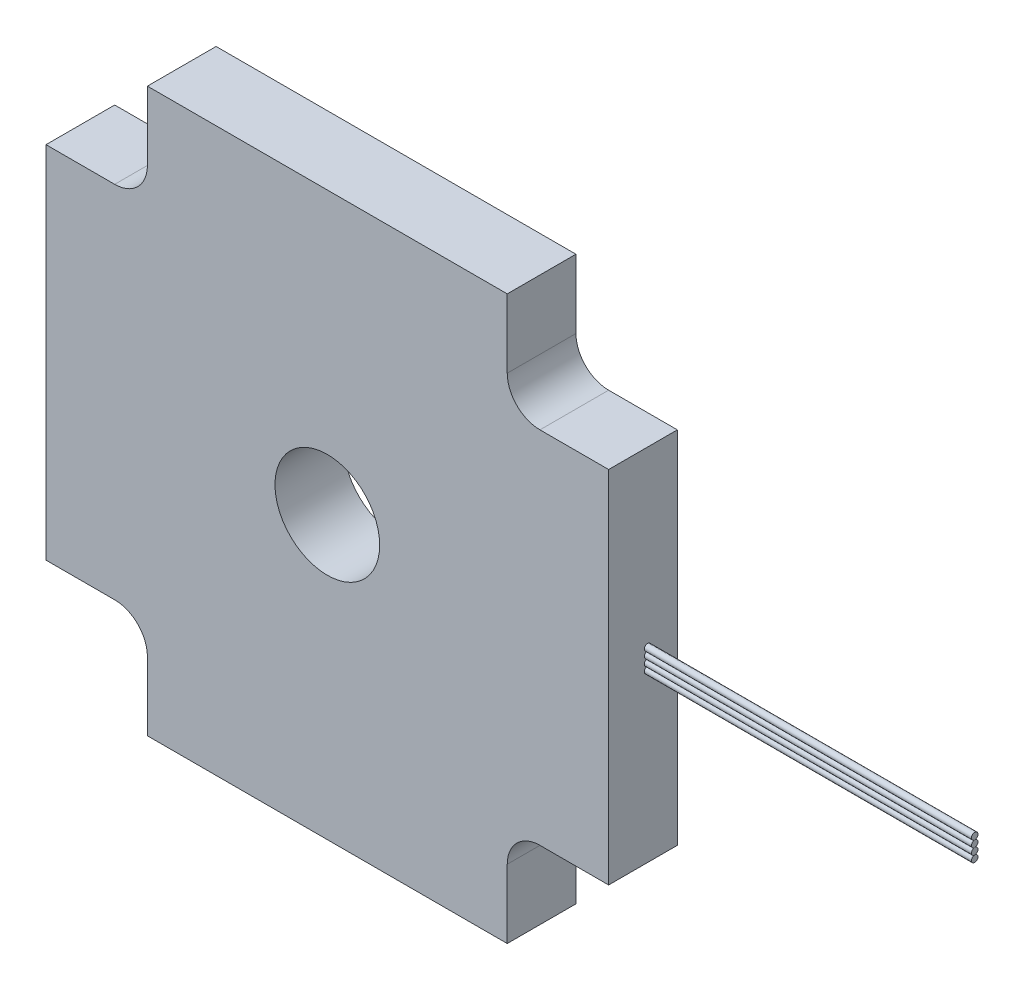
from build123d import *

# Parameters (mm, degrees)
EXTRUDE_1_DEPTH     = 10.5
SKETCH_2_R          = 8
CUT_EXTRUDE_1_DEPTH = 10.5
FILLET_1_R          = 5
FILLET_2_R          = 5
FILLET_3_R          = 5
FILLET_4_R          = 5
SKETCH_3_R          = 0.5
EXTRUDE_2_DEPTH     = 50
EXTRUDE_2_2_DEPTH   = 50
EXTRUDE_2_3_DEPTH   = 50
EXTRUDE_2_4_DEPTH   = 50


with BuildPart() as part:
    # Sketch 1 → Extrude 1 (new body)
    with BuildSketch(Plane.XY):
        Polygon((-27.5, 27.5), (-27.5, 43), (27.5, 43), (27.5, 27.5), (43, 27.5), (43, -27.5), (27.5, -27.5), (27.5, -43), (-27.5, -43), (-27.5, -27.5), (-43, -27.5), (-43, 27.5), align=None)
    extrude(amount=EXTRUDE_1_DEPTH)

    # Sketch 2 → Cut-Extrude 1 (cut)
    with BuildSketch(Plane.XY.offset(10.5)):
        Circle(SKETCH_2_R)
    extrude(amount=-CUT_EXTRUDE_1_DEPTH, mode=Mode.SUBTRACT)

    # Fillet 1
    fillet_1_edges = [part.edges().sort_by_distance(p)[0] for p in [
        (-27.5, 27.5, 5.25),
    ]]
    fillet(fillet_1_edges, radius=FILLET_1_R)

    # Fillet 2
    fillet_2_edges = [part.edges().sort_by_distance(p)[0] for p in [
        (27.5, 27.5, 5.25),
    ]]
    fillet(fillet_2_edges, radius=FILLET_2_R)

    # Fillet 3
    fillet_3_edges = [part.edges().sort_by_distance(p)[0] for p in [
        (27.5, -27.5, 5.25),
    ]]
    fillet(fillet_3_edges, radius=FILLET_3_R)

    # Fillet 4
    fillet_4_edges = [part.edges().sort_by_distance(p)[0] for p in [
        (-27.5, -27.5, 5.25),
    ]]
    fillet(fillet_4_edges, radius=FILLET_4_R)


with BuildPart() as body_2:
    # Sketch 3 → Extrude 2 (new body)
    with BuildSketch(Plane(origin=(43, 0, 0), x_dir=(0, 0, -1), z_dir=(1, 0, 0))):
        with Locations((-4.544797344, 0)):
            Circle(SKETCH_3_R)
    extrude(amount=EXTRUDE_2_DEPTH)


with BuildPart() as body_3:
    # Sketch 3 → Extrude 2 2 (new body)
    with BuildSketch(Plane(origin=(43, 0, 0), x_dir=(0, 0, -1), z_dir=(1, 0, 0))):
        with Locations((-4.544797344, 1)):
            Circle(SKETCH_3_R)
    extrude(amount=EXTRUDE_2_2_DEPTH)


with BuildPart() as body_4:
    # Sketch 3 → Extrude 2 3 (new body)
    with BuildSketch(Plane(origin=(43, 0, 0), x_dir=(0, 0, -1), z_dir=(1, 0, 0))):
        with Locations((-4.544797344, -1)):
            Circle(SKETCH_3_R)
    extrude(amount=EXTRUDE_2_3_DEPTH)


with BuildPart() as body_5:
    # Sketch 3 → Extrude 2 4 (new body)
    with BuildSketch(Plane(origin=(43, 0, 0), x_dir=(0, 0, -1), z_dir=(1, 0, 0))):
        with Locations((-4.544797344, -2)):
            Circle(SKETCH_3_R)
    extrude(amount=EXTRUDE_2_4_DEPTH)


solid = Compound([part.part, body_2.part, body_3.part, body_4.part, body_5.part])
